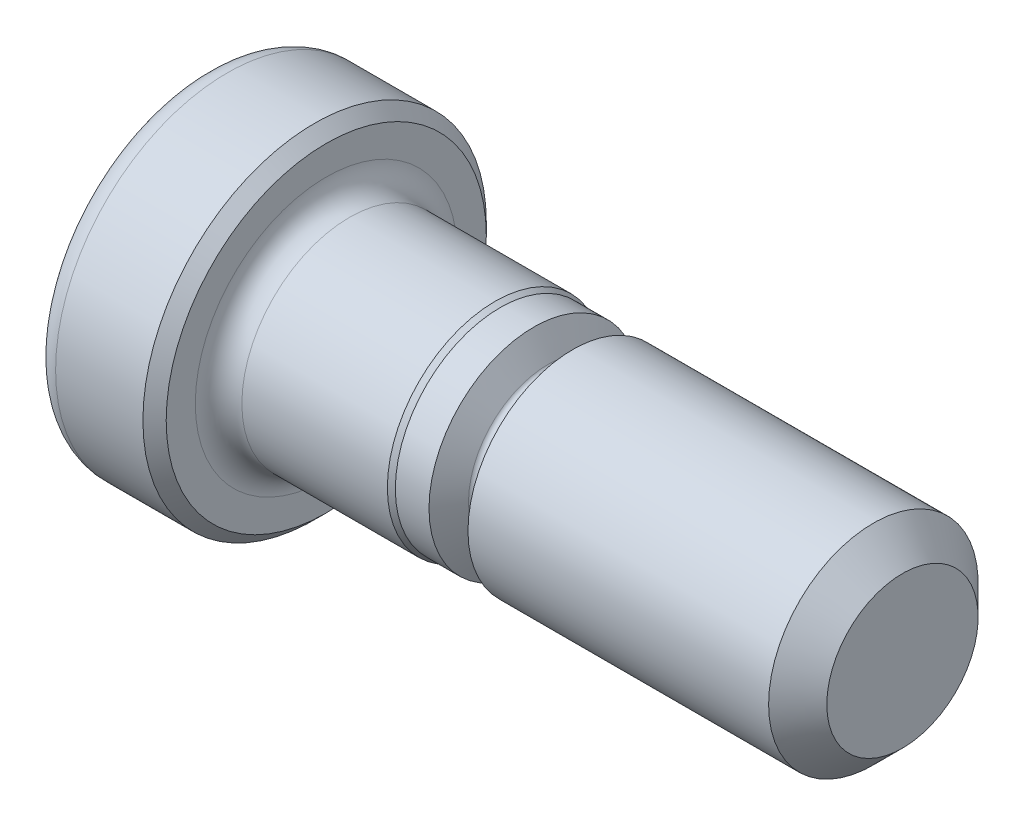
from build123d import *

# Parameters (mm, degrees)
FILLET_2_R          = 0.2
CHAMFER_1_SIZE      = 0.1
CUT_EXTRUDE_1_DEPTH = 1.3


with BuildPart() as part:
    # Sketch 1 → Revolve 1 (revolve)
    with BuildSketch(Plane.XY, mode=Mode.PRIVATE) as revolve_1_sk:
        with BuildLine():
            Line((0, 0), (0, 1.475))
            Line((0, 1.475), (1.05, 1.475))
            Line((1.05, 1.475), (1.05, 0.925))
            Line((1.05, 0.925), (2.5, 0.925))
            Line((2.5, 0.925), (2.54330127, 0.9))
            Line((2.54330127, 0.9), (2.832568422, 0.9))
            Line((2.832568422, 0.9), (2.95669873, 0.685))
            ThreePointArc((2.95669873, 0.685), (3, 0.66), (3.04330127, 0.685))
            Line((3.04330127, 0.685), (3.167431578, 0.9))
            Line((3.167431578, 0.9), (5.75, 0.9))
            Line((5.75, 0.9), (6, 0.65))
            Line((6, 0.65), (6, 0))
            Line((6, 0), (0, 0))
        make_face()
    revolve(revolve_1_sk.sketch.rotate(Axis((0, 0, 0), (1, 0, 0)), 90), axis=Axis((0, 0, 0), (1, 0, 0)))

    # Fillet 2
    fillet_2_edges = [part.edges().sort_by_distance(p)[0] for p in [
        (1.05, 0, -0.925),
        (0, 0, -1.475),
    ]]
    fillet(fillet_2_edges, radius=FILLET_2_R)

    # Chamfer 1
    chamfer_1_edges = [part.edges().sort_by_distance(p)[0] for p in [
        (1.05, 0, -1.475),
    ]]
    chamfer(chamfer_1_edges, length=CHAMFER_1_SIZE)

    # Sketch 4 → Cut-Revolve 1 (revolve, cut)
    with BuildSketch(Plane.XY, mode=Mode.PRIVATE) as cut_revolve_1_sk:
        Polygon((0, 0), (0, 0.9), (0.25, 0.65), (1.5, 0.65), (1.875277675, 0), align=None)
    revolve(cut_revolve_1_sk.sketch.rotate(Axis((0, 0, 0), (1, 0, 0)), 90), axis=Axis((0, 0, 0), (1, 0, 0)), mode=Mode.SUBTRACT)

    # Sketch 5 → Cut-Extrude 1 (cut)
    with BuildSketch(Plane.ZY):
        Polygon((0, 0.739008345), (-0.64, 0.369504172), (-0.64, -0.369504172), (0, -0.739008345), (0.64, -0.369504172), (0.64, 0.369504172), align=None)
    extrude(amount=-CUT_EXTRUDE_1_DEPTH, mode=Mode.SUBTRACT)


solid = part.part
